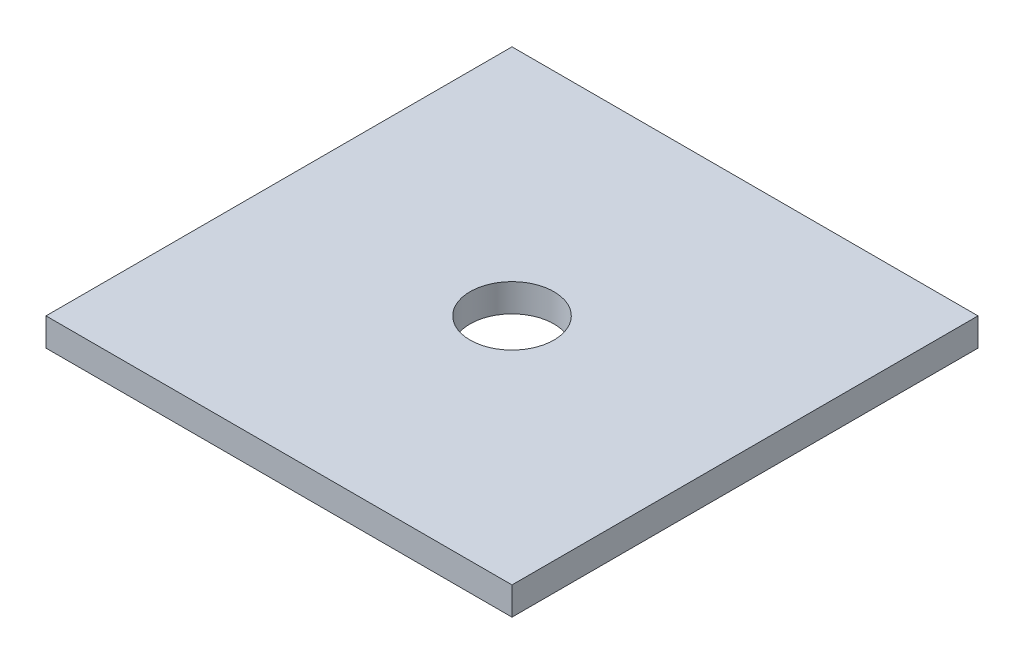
ISO-10303-21;
HEADER;
FILE_DESCRIPTION(('STEP AP214'),'2;1');
FILE_NAME('part.step','',(''),(''),'','','');
FILE_SCHEMA(('AUTOMOTIVE_DESIGN { 1 0 10303 214 1 1 1 1 }'));
ENDSEC;
DATA;
#1=APPLICATION_CONTEXT('core data for automotive mechanical design processes');
#2=APPLICATION_PROTOCOL_DEFINITION('international standard','automotive_design',2000,#1);
#3=PRODUCT_CONTEXT('',#1,'mechanical');
#4=PRODUCT('Part','Part','',(#3));
#5=PRODUCT_RELATED_PRODUCT_CATEGORY('part','',(#4));
#6=PRODUCT_DEFINITION_FORMATION('','',#4);
#7=PRODUCT_DEFINITION_CONTEXT('part definition',#1,'design');
#8=PRODUCT_DEFINITION('design','',#6,#7);
#9=PRODUCT_DEFINITION_SHAPE('','',#8);
#10=(LENGTH_UNIT() NAMED_UNIT(*) SI_UNIT(.MILLI.,.METRE.));
#11=(NAMED_UNIT(*) PLANE_ANGLE_UNIT() SI_UNIT($,.RADIAN.));
#12=(NAMED_UNIT(*) SI_UNIT($,.STERADIAN.) SOLID_ANGLE_UNIT());
#13=UNCERTAINTY_MEASURE_WITH_UNIT(LENGTH_MEASURE(1.E-05),#10,'distance_accuracy_value','');
#14=(GEOMETRIC_REPRESENTATION_CONTEXT(3) GLOBAL_UNCERTAINTY_ASSIGNED_CONTEXT((#13)) GLOBAL_UNIT_ASSIGNED_CONTEXT((#10,
#11,#12)) REPRESENTATION_CONTEXT('',''));
#15=CARTESIAN_POINT('',(0.,0.,0.));
#16=DIRECTION('',(0.,0.,1.));
#17=DIRECTION('',(1.,0.,0.));
#18=AXIS2_PLACEMENT_3D('',#15,#16,#17);
#19=CARTESIAN_POINT('',(0.,3.,-50.));
#20=DIRECTION('',(0.,-1.,0.));
#21=DIRECTION('',(0.,0.,-1.));
#22=AXIS2_PLACEMENT_3D('',#19,#20,#21);
#23=PLANE('',#22);
#24=DIRECTION('',(0.,0.,1.));
#25=VECTOR('',#24,1.);
#26=CARTESIAN_POINT('',(0.,3.,0.));
#27=LINE('',#26,#25);
#28=CARTESIAN_POINT('',(0.,3.,-50.));
#29=VERTEX_POINT('',#28);
#30=CARTESIAN_POINT('',(0.,3.,0.));
#31=VERTEX_POINT('',#30);
#32=EDGE_CURVE('E83',#29,#31,#27,.T.);
#33=ORIENTED_EDGE('',*,*,#32,.T.);
#34=DIRECTION('',(1.,0.,0.));
#35=VECTOR('',#34,1.);
#36=CARTESIAN_POINT('',(0.,3.,0.));
#37=LINE('',#36,#35);
#38=CARTESIAN_POINT('',(50.,3.,0.));
#39=VERTEX_POINT('',#38);
#40=EDGE_CURVE('E78',#31,#39,#37,.T.);
#41=ORIENTED_EDGE('',*,*,#40,.T.);
#42=DIRECTION('',(0.,0.,-1.));
#43=VECTOR('',#42,1.);
#44=CARTESIAN_POINT('',(50.,3.,0.));
#45=LINE('',#44,#43);
#46=CARTESIAN_POINT('',(50.,3.,-50.));
#47=VERTEX_POINT('',#46);
#48=EDGE_CURVE('E81',#39,#47,#45,.T.);
#49=ORIENTED_EDGE('',*,*,#48,.T.);
#50=DIRECTION('',(-1.,0.,0.));
#51=VECTOR('',#50,1.);
#52=CARTESIAN_POINT('',(0.,3.,-50.));
#53=LINE('',#52,#51);
#54=EDGE_CURVE('E48',#47,#29,#53,.T.);
#55=ORIENTED_EDGE('',*,*,#54,.T.);
#56=EDGE_LOOP('',(#33,#41,#49,#55));
#57=FACE_BOUND('',#56,.T.);
#58=CARTESIAN_POINT('',(25.,3.,-25.));
#59=DIRECTION('',(0.,1.,0.));
#60=DIRECTION('',(0.,0.,1.));
#61=AXIS2_PLACEMENT_3D('',#58,#59,#60);
#62=CIRCLE('',#61,4.5);
#63=CARTESIAN_POINT('',(25.,3.,-20.5));
#64=VERTEX_POINT('',#63);
#65=EDGE_CURVE('E98',#64,#64,#62,.T.);
#66=ORIENTED_EDGE('',*,*,#65,.F.);
#67=EDGE_LOOP('',(#66));
#68=FACE_BOUND('',#67,.T.);
#69=ADVANCED_FACE('F31',(#57,#68),#23,.F.);
#70=CARTESIAN_POINT('',(0.,0.,-50.));
#71=DIRECTION('',(0.,-1.,0.));
#72=DIRECTION('',(0.,0.,-1.));
#73=AXIS2_PLACEMENT_3D('',#70,#71,#72);
#74=PLANE('',#73);
#75=DIRECTION('',(0.,0.,1.));
#76=VECTOR('',#75,1.);
#77=CARTESIAN_POINT('',(0.,0.,0.));
#78=LINE('',#77,#76);
#79=CARTESIAN_POINT('',(0.,0.,-50.));
#80=VERTEX_POINT('',#79);
#81=CARTESIAN_POINT('',(0.,0.,0.));
#82=VERTEX_POINT('',#81);
#83=EDGE_CURVE('E95',#80,#82,#78,.T.);
#84=ORIENTED_EDGE('',*,*,#83,.F.);
#85=DIRECTION('',(-1.,0.,0.));
#86=VECTOR('',#85,1.);
#87=CARTESIAN_POINT('',(0.,0.,-50.));
#88=LINE('',#87,#86);
#89=CARTESIAN_POINT('',(50.,0.,-50.));
#90=VERTEX_POINT('',#89);
#91=EDGE_CURVE('E71',#90,#80,#88,.T.);
#92=ORIENTED_EDGE('',*,*,#91,.F.);
#93=DIRECTION('',(0.,0.,-1.));
#94=VECTOR('',#93,1.);
#95=CARTESIAN_POINT('',(50.,0.,0.));
#96=LINE('',#95,#94);
#97=CARTESIAN_POINT('',(50.,0.,0.));
#98=VERTEX_POINT('',#97);
#99=EDGE_CURVE('E65',#98,#90,#96,.T.);
#100=ORIENTED_EDGE('',*,*,#99,.F.);
#101=DIRECTION('',(1.,0.,0.));
#102=VECTOR('',#101,1.);
#103=CARTESIAN_POINT('',(0.,0.,0.));
#104=LINE('',#103,#102);
#105=EDGE_CURVE('E87',#82,#98,#104,.T.);
#106=ORIENTED_EDGE('',*,*,#105,.F.);
#107=EDGE_LOOP('',(#84,#92,#100,#106));
#108=FACE_BOUND('',#107,.T.);
#109=CARTESIAN_POINT('',(25.,0.,-25.));
#110=DIRECTION('',(0.,1.,0.));
#111=DIRECTION('',(0.,0.,1.));
#112=AXIS2_PLACEMENT_3D('',#109,#110,#111);
#113=CIRCLE('',#112,4.5);
#114=CARTESIAN_POINT('',(25.,0.,-20.5));
#115=VERTEX_POINT('',#114);
#116=EDGE_CURVE('E110',#115,#115,#113,.T.);
#117=ORIENTED_EDGE('',*,*,#116,.T.);
#118=EDGE_LOOP('',(#117));
#119=FACE_BOUND('',#118,.T.);
#120=ADVANCED_FACE('F106',(#108,#119),#74,.T.);
#121=CARTESIAN_POINT('',(0.,3.,0.));
#122=DIRECTION('',(1.,0.,0.));
#123=DIRECTION('',(0.,0.,-1.));
#124=AXIS2_PLACEMENT_3D('',#121,#122,#123);
#125=PLANE('',#124);
#126=ORIENTED_EDGE('',*,*,#83,.T.);
#127=DIRECTION('',(0.,-1.,0.));
#128=VECTOR('',#127,1.);
#129=CARTESIAN_POINT('',(0.,3.,0.));
#130=LINE('',#129,#128);
#131=EDGE_CURVE('E11',#31,#82,#130,.T.);
#132=ORIENTED_EDGE('',*,*,#131,.F.);
#133=ORIENTED_EDGE('',*,*,#32,.F.);
#134=DIRECTION('',(0.,-1.,0.));
#135=VECTOR('',#134,1.);
#136=CARTESIAN_POINT('',(0.,3.,-50.));
#137=LINE('',#136,#135);
#138=EDGE_CURVE('E91',#29,#80,#137,.T.);
#139=ORIENTED_EDGE('',*,*,#138,.T.);
#140=EDGE_LOOP('',(#126,#132,#133,#139));
#141=FACE_BOUND('',#140,.T.);
#142=ADVANCED_FACE('F33',(#141),#125,.F.);
#143=CARTESIAN_POINT('',(0.,3.,0.));
#144=DIRECTION('',(0.,0.,-1.));
#145=DIRECTION('',(-1.,0.,0.));
#146=AXIS2_PLACEMENT_3D('',#143,#144,#145);
#147=PLANE('',#146);
#148=ORIENTED_EDGE('',*,*,#105,.T.);
#149=DIRECTION('',(0.,-1.,0.));
#150=VECTOR('',#149,1.);
#151=CARTESIAN_POINT('',(50.,3.,0.));
#152=LINE('',#151,#150);
#153=EDGE_CURVE('E40',#39,#98,#152,.T.);
#154=ORIENTED_EDGE('',*,*,#153,.F.);
#155=ORIENTED_EDGE('',*,*,#40,.F.);
#156=ORIENTED_EDGE('',*,*,#131,.T.);
#157=EDGE_LOOP('',(#148,#154,#155,#156));
#158=FACE_BOUND('',#157,.T.);
#159=ADVANCED_FACE('F86',(#158),#147,.F.);
#160=CARTESIAN_POINT('',(50.,3.,0.));
#161=DIRECTION('',(-1.,0.,0.));
#162=DIRECTION('',(0.,0.,1.));
#163=AXIS2_PLACEMENT_3D('',#160,#161,#162);
#164=PLANE('',#163);
#165=ORIENTED_EDGE('',*,*,#99,.T.);
#166=DIRECTION('',(0.,-1.,0.));
#167=VECTOR('',#166,1.);
#168=CARTESIAN_POINT('',(50.,3.,-50.));
#169=LINE('',#168,#167);
#170=EDGE_CURVE('E88',#47,#90,#169,.T.);
#171=ORIENTED_EDGE('',*,*,#170,.F.);
#172=ORIENTED_EDGE('',*,*,#48,.F.);
#173=ORIENTED_EDGE('',*,*,#153,.T.);
#174=EDGE_LOOP('',(#165,#171,#172,#173));
#175=FACE_BOUND('',#174,.T.);
#176=ADVANCED_FACE('F89',(#175),#164,.F.);
#177=CARTESIAN_POINT('',(0.,3.,-50.));
#178=DIRECTION('',(0.,0.,1.));
#179=DIRECTION('',(1.,0.,0.));
#180=AXIS2_PLACEMENT_3D('',#177,#178,#179);
#181=PLANE('',#180);
#182=ORIENTED_EDGE('',*,*,#91,.T.);
#183=ORIENTED_EDGE('',*,*,#138,.F.);
#184=ORIENTED_EDGE('',*,*,#54,.F.);
#185=ORIENTED_EDGE('',*,*,#170,.T.);
#186=EDGE_LOOP('',(#182,#183,#184,#185));
#187=FACE_BOUND('',#186,.T.);
#188=ADVANCED_FACE('F103',(#187),#181,.F.);
#189=CARTESIAN_POINT('',(25.,3.,-25.));
#190=DIRECTION('',(0.,-1.,0.));
#191=DIRECTION('',(0.,0.,-1.));
#192=AXIS2_PLACEMENT_3D('',#189,#190,#191);
#193=CYLINDRICAL_SURFACE('',#192,4.5);
#194=ORIENTED_EDGE('',*,*,#65,.T.);
#195=EDGE_LOOP('',(#194));
#196=FACE_BOUND('',#195,.T.);
#197=ORIENTED_EDGE('',*,*,#116,.F.);
#198=EDGE_LOOP('',(#197));
#199=FACE_BOUND('',#198,.T.);
#200=ADVANCED_FACE('F116',(#196,#199),#193,.F.);
#201=CLOSED_SHELL('',(#69,#120,#142,#159,#176,#188,#200));
#202=MANIFOLD_SOLID_BREP('B2',#201);
#203=ADVANCED_BREP_SHAPE_REPRESENTATION('',(#18,#202),#14);
#204=SHAPE_DEFINITION_REPRESENTATION(#9,#203);
ENDSEC;
END-ISO-10303-21;
